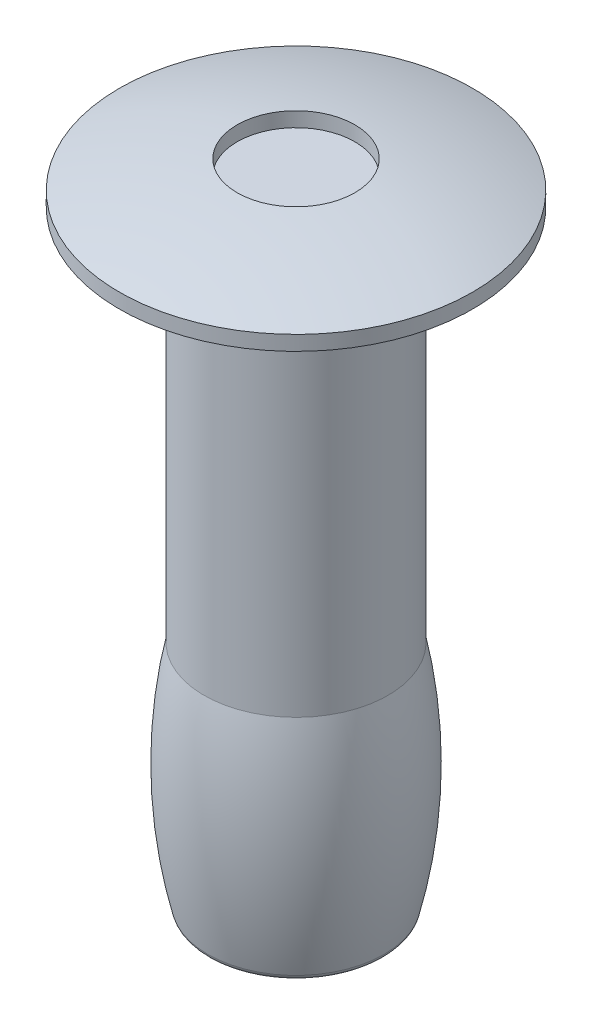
ISO-10303-21;
HEADER;
FILE_DESCRIPTION(('STEP AP214'),'2;1');
FILE_NAME('part.step','',(''),(''),'','','');
FILE_SCHEMA(('AUTOMOTIVE_DESIGN { 1 0 10303 214 1 1 1 1 }'));
ENDSEC;
DATA;
#1=APPLICATION_CONTEXT('core data for automotive mechanical design processes');
#2=APPLICATION_PROTOCOL_DEFINITION('international standard','automotive_design',2000,#1);
#3=PRODUCT_CONTEXT('',#1,'mechanical');
#4=PRODUCT('Part','Part','',(#3));
#5=PRODUCT_RELATED_PRODUCT_CATEGORY('part','',(#4));
#6=PRODUCT_DEFINITION_FORMATION('','',#4);
#7=PRODUCT_DEFINITION_CONTEXT('part definition',#1,'design');
#8=PRODUCT_DEFINITION('design','',#6,#7);
#9=PRODUCT_DEFINITION_SHAPE('','',#8);
#10=(LENGTH_UNIT() NAMED_UNIT(*) SI_UNIT(.MILLI.,.METRE.));
#11=(NAMED_UNIT(*) PLANE_ANGLE_UNIT() SI_UNIT($,.RADIAN.));
#12=(NAMED_UNIT(*) SI_UNIT($,.STERADIAN.) SOLID_ANGLE_UNIT());
#13=UNCERTAINTY_MEASURE_WITH_UNIT(LENGTH_MEASURE(1.E-05),#10,'distance_accuracy_value','');
#14=(GEOMETRIC_REPRESENTATION_CONTEXT(3) GLOBAL_UNCERTAINTY_ASSIGNED_CONTEXT((#13)) GLOBAL_UNIT_ASSIGNED_CONTEXT((#10,
#11,#12)) REPRESENTATION_CONTEXT('',''));
#15=CARTESIAN_POINT('',(0.,0.,0.));
#16=DIRECTION('',(0.,0.,1.));
#17=DIRECTION('',(1.,0.,0.));
#18=AXIS2_PLACEMENT_3D('',#15,#16,#17);
#19=CARTESIAN_POINT('',(0.,-2.84621078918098,0.));
#20=DIRECTION('',(0.,1.,0.));
#21=DIRECTION('',(1.,0.,0.));
#22=AXIS2_PLACEMENT_3D('',#19,#20,#21);
#23=SPHERICAL_SURFACE('',#22,9.08105488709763);
#24=CARTESIAN_POINT('',(0.,6.17782942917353,0.));
#25=DIRECTION('',(0.,1.,0.));
#26=DIRECTION('',(-1.,0.,0.));
#27=AXIS2_PLACEMENT_3D('',#24,#25,#26);
#28=CIRCLE('',#27,1.016);
#29=CARTESIAN_POINT('',(1.016,6.17782942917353,0.));
#30=VERTEX_POINT('',#29);
#31=EDGE_CURVE('E66',#30,#30,#28,.T.);
#32=CARTESIAN_POINT('',(0.,5.70804276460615,0.));
#33=DIRECTION('',(0.,1.,0.));
#34=DIRECTION('',(-1.,0.,0.));
#35=AXIS2_PLACEMENT_3D('',#32,#33,#34);
#36=CIRCLE('',#35,3.048);
#37=CARTESIAN_POINT('',(3.048,5.70804276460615,0.));
#38=VERTEX_POINT('',#37);
#39=EDGE_CURVE('E10',#38,#38,#36,.T.);
#40=CARTESIAN_POINT('',(1.016,6.17782942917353,0.));
#41=CARTESIAN_POINT('',(1.03763632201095,6.17539343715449,0.));
#42=CARTESIAN_POINT('',(1.05926388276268,6.17287962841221,0.));
#43=CARTESIAN_POINT('',(1.10250036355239,6.16769651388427,0.));
#44=CARTESIAN_POINT('',(1.12410928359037,6.1650272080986,0.));
#45=CARTESIAN_POINT('',(1.1673073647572,6.15953323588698,0.));
#46=CARTESIAN_POINT('',(1.18889652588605,6.15670856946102,0.));
#47=CARTESIAN_POINT('',(1.23205397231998,6.15090402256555,0.));
#48=CARTESIAN_POINT('',(1.25362225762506,6.14792414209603,0.));
#49=CARTESIAN_POINT('',(1.29673683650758,6.14180932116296,0.));
#50=CARTESIAN_POINT('',(1.31828313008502,6.13867438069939,0.));
#51=CARTESIAN_POINT('',(1.36135261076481,6.13224960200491,0.));
#52=CARTESIAN_POINT('',(1.38287579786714,6.12895976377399,0.));
#53=CARTESIAN_POINT('',(1.42589795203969,6.12222535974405,0.));
#54=CARTESIAN_POINT('',(1.44739691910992,6.11878079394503,0.));
#55=CARTESIAN_POINT('',(1.49036952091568,6.11173711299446,0.));
#56=CARTESIAN_POINT('',(1.51184315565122,6.10813799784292,0.));
#57=CARTESIAN_POINT('',(1.55476398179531,6.1007854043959,0.));
#58=CARTESIAN_POINT('',(1.57621117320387,6.09703192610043,0.));
#59=CARTESIAN_POINT('',(1.6190780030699,6.08937080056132,0.));
#60=CARTESIAN_POINT('',(1.64049764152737,6.08546315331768,0.));
#61=CARTESIAN_POINT('',(1.68330825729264,6.0774938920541,0.));
#62=CARTESIAN_POINT('',(1.70469923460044,6.07343227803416,0.));
#63=CARTESIAN_POINT('',(1.74745142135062,6.06515529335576,0.));
#64=CARTESIAN_POINT('',(1.76881263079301,6.06093992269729,0.));
#65=CARTESIAN_POINT('',(1.81150417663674,6.05235564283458,0.));
#66=CARTESIAN_POINT('',(1.83283451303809,6.04798673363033,0.));
#67=CARTESIAN_POINT('',(1.87546320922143,6.03909560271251,0.));
#68=CARTESIAN_POINT('',(1.89676156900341,6.03457338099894,0.));
#69=CARTESIAN_POINT('',(1.93932521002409,6.02537585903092,0.));
#70=CARTESIAN_POINT('',(1.96059049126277,6.02070055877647,0.));
#71=CARTESIAN_POINT('',(2.00308687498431,6.01119712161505,0.));
#72=CARTESIAN_POINT('',(2.02431797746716,6.00636898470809,0.));
#73=CARTESIAN_POINT('',(2.06674490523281,5.99656012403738,0.));
#74=CARTESIAN_POINT('',(2.08794073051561,5.99157940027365,0.));
#75=CARTESIAN_POINT('',(2.1302960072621,5.98146562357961,0.));
#76=CARTESIAN_POINT('',(2.1514554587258,5.97633257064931,0.));
#77=CARTESIAN_POINT('',(2.19373689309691,5.96591440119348,0.));
#78=CARTESIAN_POINT('',(2.21485887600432,5.96062928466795,0.));
#79=CARTESIAN_POINT('',(2.25706428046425,5.94990726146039,0.));
#80=CARTESIAN_POINT('',(2.27814770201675,5.94447035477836,0.));
#81=CARTESIAN_POINT('',(2.32027489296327,5.93344503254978,0.));
#82=CARTESIAN_POINT('',(2.34131866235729,5.92785661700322,0.));
#83=CARTESIAN_POINT('',(2.38336546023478,5.91652856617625,0.));
#84=CARTESIAN_POINT('',(2.40436848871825,5.91078893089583,0.));
#85=CARTESIAN_POINT('',(2.4463327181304,5.89915873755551,0.));
#86=CARTESIAN_POINT('',(2.46729391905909,5.89326817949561,0.));
#87=CARTESIAN_POINT('',(2.5091734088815,5.88133644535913,0.));
#88=CARTESIAN_POINT('',(2.53009169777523,5.87529526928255,0.));
#89=CARTESIAN_POINT('',(2.57188428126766,5.86306261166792,0.));
#90=CARTESIAN_POINT('',(2.59275857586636,5.85687113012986,0.));
#91=CARTESIAN_POINT('',(2.63446209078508,5.84433818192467,0.));
#92=CARTESIAN_POINT('',(2.6552913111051,5.83799671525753,0.));
#93=CARTESIAN_POINT('',(2.69690359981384,5.82516412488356,0.));
#94=CARTESIAN_POINT('',(2.71768666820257,5.81867300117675,0.));
#95=CARTESIAN_POINT('',(2.75920557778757,5.8055414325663,0.));
#96=CARTESIAN_POINT('',(2.77994141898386,5.79890098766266,0.));
#97=CARTESIAN_POINT('',(2.82136480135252,5.78547112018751,0.));
#98=CARTESIAN_POINT('',(2.84205234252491,5.778681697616,0.));
#99=CARTESIAN_POINT('',(2.88337805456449,5.76495422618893,0.));
#100=CARTESIAN_POINT('',(2.90401622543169,5.75801617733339,0.));
#101=CARTESIAN_POINT('',(2.94524212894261,5.74399181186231,0.));
#102=CARTESIAN_POINT('',(2.96582986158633,5.73690549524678,0.));
#103=CARTESIAN_POINT('',(3.00695382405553,5.72258496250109,0.));
#104=CARTESIAN_POINT('',(3.02749005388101,5.71535074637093,0.));
#105=CARTESIAN_POINT('',(3.048,5.70804276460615,0.));
#106=B_SPLINE_CURVE_WITH_KNOTS('',3,(#40,#41,#42,#43,#44,#45,#46,#47,#48,#49,#50,#51,#52,#53,
#54,#55,#56,#57,#58,#59,#60,#61,#62,#63,#64,#65,#66,#67,#68,#69,#70,#71,#72,#73,#74,#75,#76,#77,
#78,#79,#80,#81,#82,#83,#84,#85,#86,#87,#88,#89,#90,#91,#92,#93,#94,#95,#96,#97,#98,#99,#100,
#101,#102,#103,#104,#105),.UNSPECIFIED.,.F.,.F.,(4,2,2,2,2,2,2,2,2,2,2,2,2,2,2,2,2,2,2,2,2,2,2,
2,2,2,2,2,2,2,2,2,4),(0.,0.0653189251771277,0.130637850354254,0.195956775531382,
0.261275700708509,0.326594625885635,0.391913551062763,0.457232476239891,0.522551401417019,
0.587870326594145,0.653189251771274,0.718508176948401,0.783827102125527,0.849146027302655,
0.914464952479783,0.979783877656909,1.04510280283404,1.11042172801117,1.17574065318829,
1.24105957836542,1.30637850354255,1.37169742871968,1.4370163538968,1.50233527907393,
1.56765420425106,1.63297312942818,1.69829205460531,1.76361097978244,1.82892990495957,
1.89424883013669,1.95956775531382,2.02488668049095,2.09020560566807),.UNSPECIFIED.);
#107=EDGE_CURVE('BSEAM35',#30,#38,#106,.T.);
#108=ORIENTED_EDGE('',*,*,#31,.F.);
#109=ORIENTED_EDGE('',*,*,#39,.T.);
#110=ORIENTED_EDGE('',*,*,#107,.T.);
#111=ORIENTED_EDGE('',*,*,#107,.F.);
#112=EDGE_LOOP('',(#108,#110,#109,#111));
#113=FACE_BOUND('',#112,.T.);
#114=ADVANCED_FACE('F35',(#113),#23,.T.);
#115=CARTESIAN_POINT('',(0.,6.23484409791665,0.));
#116=DIRECTION('',(0.,1.,0.));
#117=DIRECTION('',(-1.,0.,0.));
#118=AXIS2_PLACEMENT_3D('',#115,#116,#117);
#119=CYLINDRICAL_SURFACE('',#118,3.048);
#120=ORIENTED_EDGE('',*,*,#39,.F.);
#121=EDGE_LOOP('',(#120));
#122=FACE_BOUND('',#121,.T.);
#123=CARTESIAN_POINT('',(0.,5.45404276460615,0.));
#124=DIRECTION('',(0.,1.,0.));
#125=DIRECTION('',(-1.,0.,0.));
#126=AXIS2_PLACEMENT_3D('',#123,#124,#125);
#127=CIRCLE('',#126,3.048);
#128=CARTESIAN_POINT('',(-3.048,5.45404276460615,0.));
#129=VERTEX_POINT('',#128);
#130=EDGE_CURVE('E41',#129,#129,#127,.T.);
#131=ORIENTED_EDGE('',*,*,#130,.T.);
#132=EDGE_LOOP('',(#131));
#133=FACE_BOUND('',#132,.T.);
#134=ADVANCED_FACE('F73',(#122,#133),#119,.T.);
#135=CARTESIAN_POINT('',(3.048,5.45404276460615,0.));
#136=DIRECTION('',(0.,1.,0.));
#137=DIRECTION('',(-1.,0.,0.));
#138=AXIS2_PLACEMENT_3D('',#135,#136,#137);
#139=PLANE('',#138);
#140=ORIENTED_EDGE('',*,*,#130,.F.);
#141=EDGE_LOOP('',(#140));
#142=FACE_BOUND('',#141,.T.);
#143=CARTESIAN_POINT('',(0.,5.45404276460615,0.));
#144=DIRECTION('',(0.,1.,0.));
#145=DIRECTION('',(-1.,0.,0.));
#146=AXIS2_PLACEMENT_3D('',#143,#144,#145);
#147=CIRCLE('',#146,1.5875);
#148=CARTESIAN_POINT('',(-1.5875,5.45404276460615,0.));
#149=VERTEX_POINT('',#148);
#150=EDGE_CURVE('E45',#149,#149,#147,.T.);
#151=ORIENTED_EDGE('',*,*,#150,.T.);
#152=EDGE_LOOP('',(#151));
#153=FACE_BOUND('',#152,.T.);
#154=ADVANCED_FACE('F77',(#142,#153),#139,.F.);
#155=CARTESIAN_POINT('',(0.,6.23484409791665,0.));
#156=DIRECTION('',(0.,1.,0.));
#157=DIRECTION('',(-1.,0.,0.));
#158=AXIS2_PLACEMENT_3D('',#155,#156,#157);
#159=CYLINDRICAL_SURFACE('',#158,1.5875);
#160=ORIENTED_EDGE('',*,*,#150,.F.);
#161=EDGE_LOOP('',(#160));
#162=FACE_BOUND('',#161,.T.);
#163=CARTESIAN_POINT('',(0.,-1.04835723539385,0.));
#164=DIRECTION('',(0.,1.,0.));
#165=DIRECTION('',(-1.,0.,0.));
#166=AXIS2_PLACEMENT_3D('',#163,#164,#165);
#167=CIRCLE('',#166,1.5875);
#168=CARTESIAN_POINT('',(-1.5875,-1.04835723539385,0.));
#169=VERTEX_POINT('',#168);
#170=EDGE_CURVE('E49',#169,#169,#167,.T.);
#171=ORIENTED_EDGE('',*,*,#170,.T.);
#172=EDGE_LOOP('',(#171));
#173=FACE_BOUND('',#172,.T.);
#174=ADVANCED_FACE('F82',(#162,#173),#159,.T.);
#175=CARTESIAN_POINT('',(0.,-2.85105522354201,0.));
#176=DIRECTION('',(0.,1.,0.));
#177=DIRECTION('',(-1.,0.,0.));
#178=AXIS2_PLACEMENT_3D('',#175,#176,#177);
#179=DEGENERATE_TOROIDAL_SURFACE('',#178,7.11780757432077,8.89,.F.);
#180=ORIENTED_EDGE('',*,*,#170,.F.);
#181=EDGE_LOOP('',(#180));
#182=FACE_BOUND('',#181,.T.);
#183=CARTESIAN_POINT('',(0.,-4.95186885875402,0.));
#184=DIRECTION('',(0.,1.,0.));
#185=DIRECTION('',(-1.,0.,0.));
#186=AXIS2_PLACEMENT_3D('',#183,#184,#185);
#187=CIRCLE('',#186,1.52040300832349);
#188=CARTESIAN_POINT('',(-1.52040300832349,-4.95186885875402,0.));
#189=VERTEX_POINT('',#188);
#190=EDGE_CURVE('E54',#189,#189,#187,.T.);
#191=ORIENTED_EDGE('',*,*,#190,.T.);
#192=EDGE_LOOP('',(#191));
#193=FACE_BOUND('',#192,.T.);
#194=ADVANCED_FACE('F88',(#182,#193),#179,.F.);
#195=CARTESIAN_POINT('',(0.,-4.92185723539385,0.));
#196=DIRECTION('',(0.,1.,0.));
#197=DIRECTION('',(-1.,0.,0.));
#198=AXIS2_PLACEMENT_3D('',#195,#196,#197);
#199=TOROIDAL_SURFACE('',#198,1.397,0.127000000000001);
#200=ORIENTED_EDGE('',*,*,#190,.F.);
#201=EDGE_LOOP('',(#200));
#202=FACE_BOUND('',#201,.T.);
#203=CARTESIAN_POINT('',(0.,-4.92185723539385,0.));
#204=DIRECTION('',(0.,1.,0.));
#205=DIRECTION('',(-1.,0.,0.));
#206=AXIS2_PLACEMENT_3D('',#203,#204,#205);
#207=CIRCLE('',#206,1.27);
#208=CARTESIAN_POINT('',(-1.27,-4.92185723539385,0.));
#209=VERTEX_POINT('',#208);
#210=EDGE_CURVE('E57',#209,#209,#207,.T.);
#211=ORIENTED_EDGE('',*,*,#210,.T.);
#212=EDGE_LOOP('',(#211));
#213=FACE_BOUND('',#212,.T.);
#214=ADVANCED_FACE('F92',(#202,#213),#199,.T.);
#215=CARTESIAN_POINT('',(0.,6.23484409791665,0.));
#216=DIRECTION('',(0.,1.,0.));
#217=DIRECTION('',(-1.,0.,0.));
#218=AXIS2_PLACEMENT_3D('',#215,#216,#217);
#219=CYLINDRICAL_SURFACE('',#218,1.27);
#220=ORIENTED_EDGE('',*,*,#210,.F.);
#221=EDGE_LOOP('',(#220));
#222=FACE_BOUND('',#221,.T.);
#223=CARTESIAN_POINT('',(0.,-4.15985723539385,0.));
#224=DIRECTION('',(0.,1.,0.));
#225=DIRECTION('',(-1.,0.,0.));
#226=AXIS2_PLACEMENT_3D('',#223,#224,#225);
#227=CIRCLE('',#226,1.27);
#228=CARTESIAN_POINT('',(-1.27,-4.15985723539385,0.));
#229=VERTEX_POINT('',#228);
#230=EDGE_CURVE('E60',#229,#229,#227,.T.);
#231=ORIENTED_EDGE('',*,*,#230,.T.);
#232=EDGE_LOOP('',(#231));
#233=FACE_BOUND('',#232,.T.);
#234=ADVANCED_FACE('F96',(#222,#233),#219,.F.);
#235=CARTESIAN_POINT('',(0.,-3.3545617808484,0.));
#236=DIRECTION('',(0.,1.,0.));
#237=DIRECTION('',(-1.,0.,0.));
#238=AXIS2_PLACEMENT_3D('',#235,#236,#237);
#239=SPHERICAL_SURFACE('',#238,1.50379545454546);
#240=ORIENTED_EDGE('',*,*,#230,.F.);
#241=EDGE_LOOP('',(#240));
#242=FACE_BOUND('',#241,.T.);
#243=ADVANCED_FACE('F100',(#242),#239,.T.);
#244=CARTESIAN_POINT('',(1.016,5.92382942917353,0.));
#245=DIRECTION('',(0.,-1.,0.));
#246=DIRECTION('',(1.,0.,0.));
#247=AXIS2_PLACEMENT_3D('',#244,#245,#246);
#248=PLANE('',#247);
#249=CARTESIAN_POINT('',(0.,5.92382942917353,0.));
#250=DIRECTION('',(0.,1.,0.));
#251=DIRECTION('',(-1.,0.,0.));
#252=AXIS2_PLACEMENT_3D('',#249,#250,#251);
#253=CIRCLE('',#252,1.016);
#254=CARTESIAN_POINT('',(-1.016,5.92382942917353,0.));
#255=VERTEX_POINT('',#254);
#256=EDGE_CURVE('E63',#255,#255,#253,.T.);
#257=ORIENTED_EDGE('',*,*,#256,.T.);
#258=EDGE_LOOP('',(#257));
#259=FACE_BOUND('',#258,.T.);
#260=ADVANCED_FACE('F104',(#259),#248,.F.);
#261=CARTESIAN_POINT('',(0.,6.23484409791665,0.));
#262=DIRECTION('',(0.,1.,0.));
#263=DIRECTION('',(-1.,0.,0.));
#264=AXIS2_PLACEMENT_3D('',#261,#262,#263);
#265=CYLINDRICAL_SURFACE('',#264,1.016);
#266=ORIENTED_EDGE('',*,*,#256,.F.);
#267=EDGE_LOOP('',(#266));
#268=FACE_BOUND('',#267,.T.);
#269=ORIENTED_EDGE('',*,*,#31,.T.);
#270=EDGE_LOOP('',(#269));
#271=FACE_BOUND('',#270,.T.);
#272=ADVANCED_FACE('F70',(#268,#271),#265,.F.);
#273=CLOSED_SHELL('',(#114,#134,#154,#174,#194,#214,#234,#243,#260,#272));
#274=MANIFOLD_SOLID_BREP('B2',#273);
#275=ADVANCED_BREP_SHAPE_REPRESENTATION('',(#18,#274),#14);
#276=SHAPE_DEFINITION_REPRESENTATION(#9,#275);
ENDSEC;
END-ISO-10303-21;
